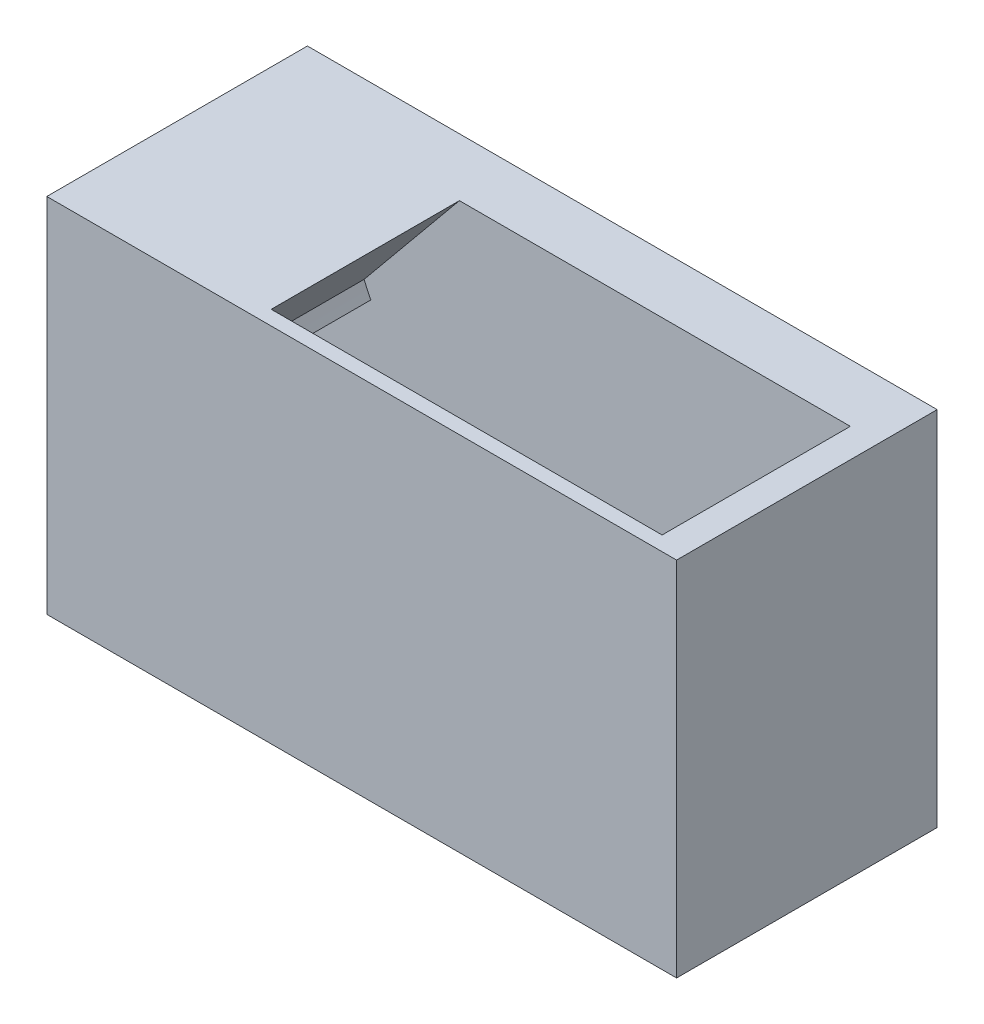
from build123d import *

# Parameters (mm, degrees)
ESQUISSE2_W                  = 435
ESQUISSE2_H                  = 180
EXTRUSION1_DEPTH             = 125
ESQUISSE3_W                  = 127
ESQUISSE3_H                  = 126
ESQUISSE3_W_2                = 130
ESQUISSE3_W_3                = 25.676934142
ESQUISSE3_H_2                = 22.736575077
ENL_V_MAT_EXTRU_1_DEPTH      = 160
ENL_V_MAT_EXTRU_2_DEPTH      = 80
ENL_V_MAT_EXTRU_2_DEPTH_BACK = 50


with BuildPart() as part:
    # Esquisse2 → Extrusion1 (new, symmetric)
    with BuildSketch(Plane(origin=(0, 0, 0), x_dir=(1, 0, 0), z_dir=(0, 1, 0))):
        Rectangle(ESQUISSE2_W, ESQUISSE2_H)
    extrude(amount=EXTRUSION1_DEPTH, both=True)

    # Esquisse3 → Enl_v. mat.-Extru.1 (cut)
    with BuildSketch(Plane.XZ.offset(125)):
        with Locations((-121, 13)):
            Rectangle(ESQUISSE3_W, ESQUISSE3_H)
        with Locations((132.5, 13)):
            Rectangle(ESQUISSE3_W_2, ESQUISSE3_H)
        with Locations((295.027080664, 134.018359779)):
            Rectangle(ESQUISSE3_W_3, ESQUISSE3_H_2)
    extrude(amount=-ENL_V_MAT_EXTRU_1_DEPTH, mode=Mode.SUBTRACT)

    # Esquisse4 → Enl_v. mat.-Extru.2 (cut, two sides: drawn at the far end of the back side and taken through both)
    with BuildSketch(Plane.XY.offset(-ENL_V_MAT_EXTRU_2_DEPTH_BACK)):
        with BuildLine():
            Line((197.5, 125), (138.332931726, 45))
            ThreePointArc((138.332931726, 45), (0, -47), (-138.332931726, 45))
            Line((-138.332931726, 45), (-72.5, 125))
            Line((-72.5, 125), (197.5, 125))
        make_face()
    extrude(amount=ENL_V_MAT_EXTRU_2_DEPTH + ENL_V_MAT_EXTRU_2_DEPTH_BACK, mode=Mode.SUBTRACT)


solid = part.part
